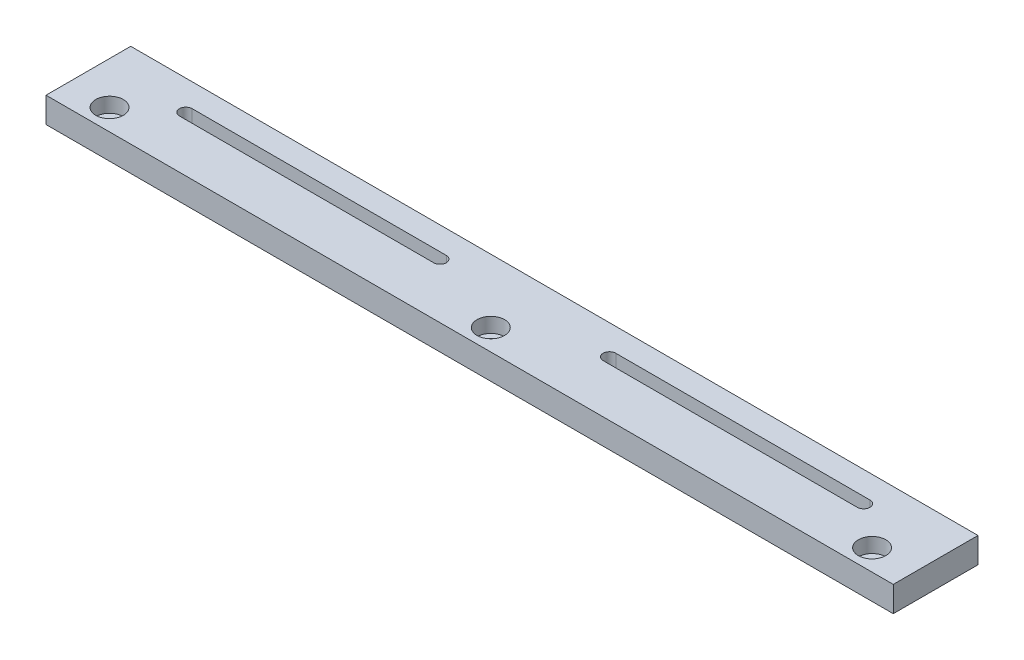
ISO-10303-21;
HEADER;
FILE_DESCRIPTION(('STEP AP214'),'2;1');
FILE_NAME('part.step','',(''),(''),'','','');
FILE_SCHEMA(('AUTOMOTIVE_DESIGN { 1 0 10303 214 1 1 1 1 }'));
ENDSEC;
DATA;
#1=APPLICATION_CONTEXT('core data for automotive mechanical design processes');
#2=APPLICATION_PROTOCOL_DEFINITION('international standard','automotive_design',2000,#1);
#3=PRODUCT_CONTEXT('',#1,'mechanical');
#4=PRODUCT('Part','Part','',(#3));
#5=PRODUCT_RELATED_PRODUCT_CATEGORY('part','',(#4));
#6=PRODUCT_DEFINITION_FORMATION('','',#4);
#7=PRODUCT_DEFINITION_CONTEXT('part definition',#1,'design');
#8=PRODUCT_DEFINITION('design','',#6,#7);
#9=PRODUCT_DEFINITION_SHAPE('','',#8);
#10=(LENGTH_UNIT() NAMED_UNIT(*) SI_UNIT(.MILLI.,.METRE.));
#11=(NAMED_UNIT(*) PLANE_ANGLE_UNIT() SI_UNIT($,.RADIAN.));
#12=(NAMED_UNIT(*) SI_UNIT($,.STERADIAN.) SOLID_ANGLE_UNIT());
#13=UNCERTAINTY_MEASURE_WITH_UNIT(LENGTH_MEASURE(1.E-05),#10,'distance_accuracy_value','');
#14=(GEOMETRIC_REPRESENTATION_CONTEXT(3) GLOBAL_UNCERTAINTY_ASSIGNED_CONTEXT((#13)) GLOBAL_UNIT_ASSIGNED_CONTEXT((#10,
#11,#12)) REPRESENTATION_CONTEXT('',''));
#15=CARTESIAN_POINT('',(0.,0.,0.));
#16=DIRECTION('',(0.,0.,1.));
#17=DIRECTION('',(1.,0.,0.));
#18=AXIS2_PLACEMENT_3D('',#15,#16,#17);
#19=CARTESIAN_POINT('',(190.,-14.,15.));
#20=DIRECTION('',(0.,1.,0.));
#21=DIRECTION('',(0.,0.,1.));
#22=AXIS2_PLACEMENT_3D('',#19,#20,#21);
#23=CYLINDRICAL_SURFACE('',#22,1.75);
#24=CARTESIAN_POINT('',(190.,0.,15.));
#25=DIRECTION('',(0.,1.,0.));
#26=DIRECTION('',(0.,0.,1.));
#27=AXIS2_PLACEMENT_3D('',#24,#25,#26);
#28=CIRCLE('',#27,1.75);
#29=CARTESIAN_POINT('',(190.,0.,16.75));
#30=VERTEX_POINT('',#29);
#31=EDGE_CURVE('E192',#30,#30,#28,.T.);
#32=ORIENTED_EDGE('',*,*,#31,.F.);
#33=EDGE_LOOP('',(#32));
#34=FACE_BOUND('',#33,.T.);
#35=CARTESIAN_POINT('',(190.,2.5,15.));
#36=DIRECTION('',(0.,1.,0.));
#37=DIRECTION('',(0.,0.,1.));
#38=AXIS2_PLACEMENT_3D('',#35,#36,#37);
#39=CIRCLE('',#38,1.75);
#40=CARTESIAN_POINT('',(190.,2.5,16.75));
#41=VERTEX_POINT('',#40);
#42=EDGE_CURVE('E36',#41,#41,#39,.F.);
#43=ORIENTED_EDGE('',*,*,#42,.F.);
#44=EDGE_LOOP('',(#43));
#45=FACE_BOUND('',#44,.T.);
#46=ADVANCED_FACE('F32',(#34,#45),#23,.F.);
#47=CARTESIAN_POINT('',(100.,-14.,15.));
#48=DIRECTION('',(0.,1.,0.));
#49=DIRECTION('',(0.,0.,1.));
#50=AXIS2_PLACEMENT_3D('',#47,#48,#49);
#51=CYLINDRICAL_SURFACE('',#50,1.75);
#52=CARTESIAN_POINT('',(100.,0.,15.));
#53=DIRECTION('',(0.,1.,0.));
#54=DIRECTION('',(0.,0.,1.));
#55=AXIS2_PLACEMENT_3D('',#52,#53,#54);
#56=CIRCLE('',#55,1.75);
#57=CARTESIAN_POINT('',(100.,0.,16.75));
#58=VERTEX_POINT('',#57);
#59=EDGE_CURVE('E195',#58,#58,#56,.T.);
#60=ORIENTED_EDGE('',*,*,#59,.F.);
#61=EDGE_LOOP('',(#60));
#62=FACE_BOUND('',#61,.T.);
#63=CARTESIAN_POINT('',(100.,2.5,15.));
#64=DIRECTION('',(0.,1.,0.));
#65=DIRECTION('',(0.,0.,1.));
#66=AXIS2_PLACEMENT_3D('',#63,#64,#65);
#67=CIRCLE('',#66,1.75);
#68=CARTESIAN_POINT('',(100.,2.5,16.75));
#69=VERTEX_POINT('',#68);
#70=EDGE_CURVE('E230',#69,#69,#67,.F.);
#71=ORIENTED_EDGE('',*,*,#70,.F.);
#72=EDGE_LOOP('',(#71));
#73=FACE_BOUND('',#72,.T.);
#74=ADVANCED_FACE('F278',(#62,#73),#51,.F.);
#75=CARTESIAN_POINT('',(10.,-14.,15.));
#76=DIRECTION('',(0.,1.,0.));
#77=DIRECTION('',(0.,0.,1.));
#78=AXIS2_PLACEMENT_3D('',#75,#76,#77);
#79=CYLINDRICAL_SURFACE('',#78,1.75);
#80=CARTESIAN_POINT('',(10.,0.,15.));
#81=DIRECTION('',(0.,1.,0.));
#82=DIRECTION('',(0.,0.,1.));
#83=AXIS2_PLACEMENT_3D('',#80,#81,#82);
#84=CIRCLE('',#83,1.75);
#85=CARTESIAN_POINT('',(10.,0.,16.75));
#86=VERTEX_POINT('',#85);
#87=EDGE_CURVE('E198',#86,#86,#84,.T.);
#88=ORIENTED_EDGE('',*,*,#87,.F.);
#89=EDGE_LOOP('',(#88));
#90=FACE_BOUND('',#89,.T.);
#91=CARTESIAN_POINT('',(10.,2.5,15.));
#92=DIRECTION('',(0.,1.,0.));
#93=DIRECTION('',(0.,0.,1.));
#94=AXIS2_PLACEMENT_3D('',#91,#92,#93);
#95=CIRCLE('',#94,1.75);
#96=CARTESIAN_POINT('',(10.,2.5,16.75));
#97=VERTEX_POINT('',#96);
#98=EDGE_CURVE('E227',#97,#97,#95,.F.);
#99=ORIENTED_EDGE('',*,*,#98,.F.);
#100=EDGE_LOOP('',(#99));
#101=FACE_BOUND('',#100,.T.);
#102=ADVANCED_FACE('F284',(#90,#101),#79,.F.);
#103=CARTESIAN_POINT('',(0.,0.,20.));
#104=DIRECTION('',(0.,1.,0.));
#105=DIRECTION('',(0.,0.,1.));
#106=AXIS2_PLACEMENT_3D('',#103,#104,#105);
#107=PLANE('',#106);
#108=DIRECTION('',(-1.,0.,0.));
#109=VECTOR('',#108,1.);
#110=CARTESIAN_POINT('',(0.,0.,5.5));
#111=LINE('',#110,#109);
#112=CARTESIAN_POINT('',(180.,0.,5.5));
#113=VERTEX_POINT('',#112);
#114=CARTESIAN_POINT('',(120.,0.,5.5));
#115=VERTEX_POINT('',#114);
#116=EDGE_CURVE('E154',#113,#115,#111,.T.);
#117=ORIENTED_EDGE('',*,*,#116,.T.);
#118=CARTESIAN_POINT('',(120.,0.,7.));
#119=DIRECTION('',(0.,1.,0.));
#120=DIRECTION('',(0.,0.,1.));
#121=AXIS2_PLACEMENT_3D('',#118,#119,#120);
#122=CIRCLE('',#121,1.5);
#123=CARTESIAN_POINT('',(120.,0.,8.5));
#124=VERTEX_POINT('',#123);
#125=EDGE_CURVE('E157',#115,#124,#122,.T.);
#126=ORIENTED_EDGE('',*,*,#125,.T.);
#127=DIRECTION('',(1.,0.,0.));
#128=VECTOR('',#127,1.);
#129=CARTESIAN_POINT('',(0.,0.,8.5));
#130=LINE('',#129,#128);
#131=CARTESIAN_POINT('',(180.,0.,8.5));
#132=VERTEX_POINT('',#131);
#133=EDGE_CURVE('E149',#124,#132,#130,.T.);
#134=ORIENTED_EDGE('',*,*,#133,.T.);
#135=CARTESIAN_POINT('',(180.,0.,7.));
#136=DIRECTION('',(0.,1.,0.));
#137=DIRECTION('',(0.,0.,1.));
#138=AXIS2_PLACEMENT_3D('',#135,#136,#137);
#139=CIRCLE('',#138,1.5);
#140=EDGE_CURVE('E129',#132,#113,#139,.T.);
#141=ORIENTED_EDGE('',*,*,#140,.T.);
#142=EDGE_LOOP('',(#117,#126,#134,#141));
#143=FACE_BOUND('',#142,.T.);
#144=DIRECTION('',(-1.,0.,0.));
#145=VECTOR('',#144,1.);
#146=CARTESIAN_POINT('',(0.,0.,5.5));
#147=LINE('',#146,#145);
#148=CARTESIAN_POINT('',(80.,0.,5.5));
#149=VERTEX_POINT('',#148);
#150=CARTESIAN_POINT('',(20.,0.,5.5));
#151=VERTEX_POINT('',#150);
#152=EDGE_CURVE('E186',#149,#151,#147,.T.);
#153=ORIENTED_EDGE('',*,*,#152,.T.);
#154=CARTESIAN_POINT('',(20.,0.,7.));
#155=DIRECTION('',(0.,1.,0.));
#156=DIRECTION('',(0.,0.,1.));
#157=AXIS2_PLACEMENT_3D('',#154,#155,#156);
#158=CIRCLE('',#157,1.5);
#159=CARTESIAN_POINT('',(20.,0.,8.5));
#160=VERTEX_POINT('',#159);
#161=EDGE_CURVE('E189',#151,#160,#158,.T.);
#162=ORIENTED_EDGE('',*,*,#161,.T.);
#163=DIRECTION('',(1.,0.,0.));
#164=VECTOR('',#163,1.);
#165=CARTESIAN_POINT('',(0.,0.,8.5));
#166=LINE('',#165,#164);
#167=CARTESIAN_POINT('',(80.,0.,8.5));
#168=VERTEX_POINT('',#167);
#169=EDGE_CURVE('E174',#160,#168,#166,.T.);
#170=ORIENTED_EDGE('',*,*,#169,.T.);
#171=CARTESIAN_POINT('',(80.,0.,7.));
#172=DIRECTION('',(0.,1.,0.));
#173=DIRECTION('',(0.,0.,1.));
#174=AXIS2_PLACEMENT_3D('',#171,#172,#173);
#175=CIRCLE('',#174,1.5);
#176=EDGE_CURVE('E183',#168,#149,#175,.T.);
#177=ORIENTED_EDGE('',*,*,#176,.T.);
#178=EDGE_LOOP('',(#153,#162,#170,#177));
#179=FACE_BOUND('',#178,.T.);
#180=ORIENTED_EDGE('',*,*,#31,.T.);
#181=EDGE_LOOP('',(#180));
#182=FACE_BOUND('',#181,.T.);
#183=ORIENTED_EDGE('',*,*,#59,.T.);
#184=EDGE_LOOP('',(#183));
#185=FACE_BOUND('',#184,.T.);
#186=ORIENTED_EDGE('',*,*,#87,.T.);
#187=EDGE_LOOP('',(#186));
#188=FACE_BOUND('',#187,.T.);
#189=DIRECTION('',(1.,0.,0.));
#190=VECTOR('',#189,1.);
#191=CARTESIAN_POINT('',(0.,0.,0.));
#192=LINE('',#191,#190);
#193=CARTESIAN_POINT('',(0.,0.,0.));
#194=VERTEX_POINT('',#193);
#195=CARTESIAN_POINT('',(200.,0.,0.));
#196=VERTEX_POINT('',#195);
#197=EDGE_CURVE('E201',#194,#196,#192,.T.);
#198=ORIENTED_EDGE('',*,*,#197,.T.);
#199=DIRECTION('',(0.,0.,-1.));
#200=VECTOR('',#199,1.);
#201=CARTESIAN_POINT('',(200.,0.,20.));
#202=LINE('',#201,#200);
#203=CARTESIAN_POINT('',(200.,0.,20.));
#204=VERTEX_POINT('',#203);
#205=EDGE_CURVE('E11',#204,#196,#202,.T.);
#206=ORIENTED_EDGE('',*,*,#205,.F.);
#207=DIRECTION('',(1.,0.,0.));
#208=VECTOR('',#207,1.);
#209=CARTESIAN_POINT('',(0.,0.,20.));
#210=LINE('',#209,#208);
#211=CARTESIAN_POINT('',(0.,0.,20.));
#212=VERTEX_POINT('',#211);
#213=EDGE_CURVE('E202',#212,#204,#210,.T.);
#214=ORIENTED_EDGE('',*,*,#213,.F.);
#215=DIRECTION('',(0.,0.,-1.));
#216=VECTOR('',#215,1.);
#217=CARTESIAN_POINT('',(0.,0.,20.));
#218=LINE('',#217,#216);
#219=EDGE_CURVE('E212',#212,#194,#218,.T.);
#220=ORIENTED_EDGE('',*,*,#219,.T.);
#221=EDGE_LOOP('',(#198,#206,#214,#220));
#222=FACE_BOUND('',#221,.T.);
#223=ADVANCED_FACE('F34',(#143,#179,#182,#185,#188,#222),#107,.F.);
#224=CARTESIAN_POINT('',(200.,0.,20.));
#225=DIRECTION('',(-1.,0.,0.));
#226=DIRECTION('',(0.,0.,1.));
#227=AXIS2_PLACEMENT_3D('',#224,#225,#226);
#228=PLANE('',#227);
#229=DIRECTION('',(0.,1.,0.));
#230=VECTOR('',#229,1.);
#231=CARTESIAN_POINT('',(200.,0.,0.));
#232=LINE('',#231,#230);
#233=CARTESIAN_POINT('',(200.,6.,0.));
#234=VERTEX_POINT('',#233);
#235=EDGE_CURVE('E215',#196,#234,#232,.T.);
#236=ORIENTED_EDGE('',*,*,#235,.T.);
#237=DIRECTION('',(0.,0.,-1.));
#238=VECTOR('',#237,1.);
#239=CARTESIAN_POINT('',(200.,6.,20.));
#240=LINE('',#239,#238);
#241=CARTESIAN_POINT('',(200.,6.,20.));
#242=VERTEX_POINT('',#241);
#243=EDGE_CURVE('E41',#242,#234,#240,.T.);
#244=ORIENTED_EDGE('',*,*,#243,.F.);
#245=DIRECTION('',(0.,1.,0.));
#246=VECTOR('',#245,1.);
#247=CARTESIAN_POINT('',(200.,0.,20.));
#248=LINE('',#247,#246);
#249=EDGE_CURVE('E205',#204,#242,#248,.T.);
#250=ORIENTED_EDGE('',*,*,#249,.F.);
#251=ORIENTED_EDGE('',*,*,#205,.T.);
#252=EDGE_LOOP('',(#236,#244,#250,#251));
#253=FACE_BOUND('',#252,.T.);
#254=ADVANCED_FACE('F264',(#253),#228,.F.);
#255=CARTESIAN_POINT('',(0.,6.,20.));
#256=DIRECTION('',(0.,-1.,0.));
#257=DIRECTION('',(0.,0.,-1.));
#258=AXIS2_PLACEMENT_3D('',#255,#256,#257);
#259=PLANE('',#258);
#260=CARTESIAN_POINT('',(190.,6.,15.));
#261=DIRECTION('',(0.,1.,0.));
#262=DIRECTION('',(0.,0.,1.));
#263=AXIS2_PLACEMENT_3D('',#260,#261,#262);
#264=CIRCLE('',#263,3.25);
#265=CARTESIAN_POINT('',(190.,6.,18.25));
#266=VERTEX_POINT('',#265);
#267=EDGE_CURVE('E246',#266,#266,#264,.T.);
#268=ORIENTED_EDGE('',*,*,#267,.F.);
#269=EDGE_LOOP('',(#268));
#270=FACE_BOUND('',#269,.T.);
#271=CARTESIAN_POINT('',(100.,6.,15.));
#272=DIRECTION('',(0.,1.,0.));
#273=DIRECTION('',(0.,0.,1.));
#274=AXIS2_PLACEMENT_3D('',#271,#272,#273);
#275=CIRCLE('',#274,3.25);
#276=CARTESIAN_POINT('',(100.,6.,18.25));
#277=VERTEX_POINT('',#276);
#278=EDGE_CURVE('E239',#277,#277,#275,.T.);
#279=ORIENTED_EDGE('',*,*,#278,.F.);
#280=EDGE_LOOP('',(#279));
#281=FACE_BOUND('',#280,.T.);
#282=CARTESIAN_POINT('',(10.,6.,15.));
#283=DIRECTION('',(0.,1.,0.));
#284=DIRECTION('',(0.,0.,1.));
#285=AXIS2_PLACEMENT_3D('',#282,#283,#284);
#286=CIRCLE('',#285,3.25);
#287=CARTESIAN_POINT('',(10.,6.,18.25));
#288=VERTEX_POINT('',#287);
#289=EDGE_CURVE('E232',#288,#288,#286,.T.);
#290=ORIENTED_EDGE('',*,*,#289,.F.);
#291=EDGE_LOOP('',(#290));
#292=FACE_BOUND('',#291,.T.);
#293=DIRECTION('',(1.,0.,0.));
#294=VECTOR('',#293,1.);
#295=CARTESIAN_POINT('',(120.,6.,8.5));
#296=LINE('',#295,#294);
#297=CARTESIAN_POINT('',(120.,6.,8.5));
#298=VERTEX_POINT('',#297);
#299=CARTESIAN_POINT('',(180.,6.,8.5));
#300=VERTEX_POINT('',#299);
#301=EDGE_CURVE('E135',#298,#300,#296,.T.);
#302=ORIENTED_EDGE('',*,*,#301,.F.);
#303=CARTESIAN_POINT('',(120.,6.,7.));
#304=DIRECTION('',(0.,1.,0.));
#305=DIRECTION('',(0.,0.,1.));
#306=AXIS2_PLACEMENT_3D('',#303,#304,#305);
#307=CIRCLE('',#306,1.5);
#308=CARTESIAN_POINT('',(120.,6.,5.5));
#309=VERTEX_POINT('',#308);
#310=EDGE_CURVE('E57',#309,#298,#307,.T.);
#311=ORIENTED_EDGE('',*,*,#310,.F.);
#312=DIRECTION('',(-1.,0.,0.));
#313=VECTOR('',#312,1.);
#314=CARTESIAN_POINT('',(120.,6.,5.5));
#315=LINE('',#314,#313);
#316=CARTESIAN_POINT('',(180.,6.,5.5));
#317=VERTEX_POINT('',#316);
#318=EDGE_CURVE('E142',#317,#309,#315,.T.);
#319=ORIENTED_EDGE('',*,*,#318,.F.);
#320=CARTESIAN_POINT('',(180.,6.,7.));
#321=DIRECTION('',(0.,1.,0.));
#322=DIRECTION('',(0.,0.,1.));
#323=AXIS2_PLACEMENT_3D('',#320,#321,#322);
#324=CIRCLE('',#323,1.5);
#325=EDGE_CURVE('E126',#300,#317,#324,.T.);
#326=ORIENTED_EDGE('',*,*,#325,.F.);
#327=EDGE_LOOP('',(#302,#311,#319,#326));
#328=FACE_BOUND('',#327,.T.);
#329=DIRECTION('',(1.,0.,0.));
#330=VECTOR('',#329,1.);
#331=CARTESIAN_POINT('',(20.,6.,8.5));
#332=LINE('',#331,#330);
#333=CARTESIAN_POINT('',(20.,6.,8.5));
#334=VERTEX_POINT('',#333);
#335=CARTESIAN_POINT('',(80.,6.,8.5));
#336=VERTEX_POINT('',#335);
#337=EDGE_CURVE('E162',#334,#336,#332,.T.);
#338=ORIENTED_EDGE('',*,*,#337,.F.);
#339=CARTESIAN_POINT('',(20.,6.,7.));
#340=DIRECTION('',(0.,1.,0.));
#341=DIRECTION('',(0.,0.,1.));
#342=AXIS2_PLACEMENT_3D('',#339,#340,#341);
#343=CIRCLE('',#342,1.5);
#344=CARTESIAN_POINT('',(20.,6.,5.5));
#345=VERTEX_POINT('',#344);
#346=EDGE_CURVE('E160',#345,#334,#343,.T.);
#347=ORIENTED_EDGE('',*,*,#346,.F.);
#348=DIRECTION('',(-1.,0.,0.));
#349=VECTOR('',#348,1.);
#350=CARTESIAN_POINT('',(20.,6.,5.5));
#351=LINE('',#350,#349);
#352=CARTESIAN_POINT('',(80.,6.,5.5));
#353=VERTEX_POINT('',#352);
#354=EDGE_CURVE('E168',#353,#345,#351,.T.);
#355=ORIENTED_EDGE('',*,*,#354,.F.);
#356=CARTESIAN_POINT('',(80.,6.,7.));
#357=DIRECTION('',(0.,1.,0.));
#358=DIRECTION('',(0.,0.,1.));
#359=AXIS2_PLACEMENT_3D('',#356,#357,#358);
#360=CIRCLE('',#359,1.5);
#361=EDGE_CURVE('E165',#336,#353,#360,.T.);
#362=ORIENTED_EDGE('',*,*,#361,.F.);
#363=EDGE_LOOP('',(#338,#347,#355,#362));
#364=FACE_BOUND('',#363,.T.);
#365=DIRECTION('',(-1.,0.,0.));
#366=VECTOR('',#365,1.);
#367=CARTESIAN_POINT('',(0.,6.,0.));
#368=LINE('',#367,#366);
#369=CARTESIAN_POINT('',(0.,6.,0.));
#370=VERTEX_POINT('',#369);
#371=EDGE_CURVE('E217',#234,#370,#368,.T.);
#372=ORIENTED_EDGE('',*,*,#371,.T.);
#373=DIRECTION('',(0.,0.,-1.));
#374=VECTOR('',#373,1.);
#375=CARTESIAN_POINT('',(0.,6.,20.));
#376=LINE('',#375,#374);
#377=CARTESIAN_POINT('',(0.,6.,20.));
#378=VERTEX_POINT('',#377);
#379=EDGE_CURVE('E222',#378,#370,#376,.T.);
#380=ORIENTED_EDGE('',*,*,#379,.F.);
#381=DIRECTION('',(-1.,0.,0.));
#382=VECTOR('',#381,1.);
#383=CARTESIAN_POINT('',(0.,6.,20.));
#384=LINE('',#383,#382);
#385=EDGE_CURVE('E208',#242,#378,#384,.T.);
#386=ORIENTED_EDGE('',*,*,#385,.F.);
#387=ORIENTED_EDGE('',*,*,#243,.T.);
#388=EDGE_LOOP('',(#372,#380,#386,#387));
#389=FACE_BOUND('',#388,.T.);
#390=ADVANCED_FACE('F139',(#270,#281,#292,#328,#364,#389),#259,.F.);
#391=CARTESIAN_POINT('',(0.,0.,20.));
#392=DIRECTION('',(1.,0.,0.));
#393=DIRECTION('',(0.,0.,-1.));
#394=AXIS2_PLACEMENT_3D('',#391,#392,#393);
#395=PLANE('',#394);
#396=DIRECTION('',(0.,-1.,0.));
#397=VECTOR('',#396,1.);
#398=CARTESIAN_POINT('',(0.,0.,0.));
#399=LINE('',#398,#397);
#400=EDGE_CURVE('E206',#370,#194,#399,.T.);
#401=ORIENTED_EDGE('',*,*,#400,.T.);
#402=ORIENTED_EDGE('',*,*,#219,.F.);
#403=DIRECTION('',(0.,-1.,0.));
#404=VECTOR('',#403,1.);
#405=CARTESIAN_POINT('',(0.,0.,20.));
#406=LINE('',#405,#404);
#407=EDGE_CURVE('E210',#378,#212,#406,.T.);
#408=ORIENTED_EDGE('',*,*,#407,.F.);
#409=ORIENTED_EDGE('',*,*,#379,.T.);
#410=EDGE_LOOP('',(#401,#402,#408,#409));
#411=FACE_BOUND('',#410,.T.);
#412=ADVANCED_FACE('F263',(#411),#395,.F.);
#413=CARTESIAN_POINT('',(200.,0.,20.));
#414=DIRECTION('',(0.,0.,1.));
#415=DIRECTION('',(1.,0.,0.));
#416=AXIS2_PLACEMENT_3D('',#413,#414,#415);
#417=PLANE('',#416);
#418=ORIENTED_EDGE('',*,*,#213,.T.);
#419=ORIENTED_EDGE('',*,*,#249,.T.);
#420=ORIENTED_EDGE('',*,*,#385,.T.);
#421=ORIENTED_EDGE('',*,*,#407,.T.);
#422=EDGE_LOOP('',(#418,#419,#420,#421));
#423=FACE_BOUND('',#422,.T.);
#424=ADVANCED_FACE('F271',(#423),#417,.T.);
#425=CARTESIAN_POINT('',(200.,0.,0.));
#426=DIRECTION('',(0.,0.,1.));
#427=DIRECTION('',(1.,0.,0.));
#428=AXIS2_PLACEMENT_3D('',#425,#426,#427);
#429=PLANE('',#428);
#430=ORIENTED_EDGE('',*,*,#197,.F.);
#431=ORIENTED_EDGE('',*,*,#400,.F.);
#432=ORIENTED_EDGE('',*,*,#371,.F.);
#433=ORIENTED_EDGE('',*,*,#235,.F.);
#434=EDGE_LOOP('',(#430,#431,#432,#433));
#435=FACE_BOUND('',#434,.T.);
#436=ADVANCED_FACE('F298',(#435),#429,.F.);
#437=CARTESIAN_POINT('',(20.,-14.,7.));
#438=DIRECTION('',(0.,1.,0.));
#439=DIRECTION('',(0.,0.,1.));
#440=AXIS2_PLACEMENT_3D('',#437,#438,#439);
#441=CYLINDRICAL_SURFACE('',#440,1.5);
#442=DIRECTION('',(0.,1.,0.));
#443=VECTOR('',#442,1.);
#444=CARTESIAN_POINT('',(20.,-14.,5.5));
#445=LINE('',#444,#443);
#446=EDGE_CURVE('E172',#151,#345,#445,.T.);
#447=ORIENTED_EDGE('',*,*,#446,.T.);
#448=ORIENTED_EDGE('',*,*,#346,.T.);
#449=DIRECTION('',(0.,1.,0.));
#450=VECTOR('',#449,1.);
#451=CARTESIAN_POINT('',(20.,-14.,8.5));
#452=LINE('',#451,#450);
#453=EDGE_CURVE('E171',#160,#334,#452,.T.);
#454=ORIENTED_EDGE('',*,*,#453,.F.);
#455=ORIENTED_EDGE('',*,*,#161,.F.);
#456=EDGE_LOOP('',(#447,#448,#454,#455));
#457=FACE_BOUND('',#456,.T.);
#458=ADVANCED_FACE('F290',(#457),#441,.F.);
#459=CARTESIAN_POINT('',(20.,-14.,5.5));
#460=DIRECTION('',(0.,0.,-1.));
#461=DIRECTION('',(-1.,0.,0.));
#462=AXIS2_PLACEMENT_3D('',#459,#460,#461);
#463=PLANE('',#462);
#464=DIRECTION('',(0.,1.,0.));
#465=VECTOR('',#464,1.);
#466=CARTESIAN_POINT('',(80.,-14.,5.5));
#467=LINE('',#466,#465);
#468=EDGE_CURVE('E175',#149,#353,#467,.T.);
#469=ORIENTED_EDGE('',*,*,#468,.T.);
#470=ORIENTED_EDGE('',*,*,#354,.T.);
#471=ORIENTED_EDGE('',*,*,#446,.F.);
#472=ORIENTED_EDGE('',*,*,#152,.F.);
#473=EDGE_LOOP('',(#469,#470,#471,#472));
#474=FACE_BOUND('',#473,.T.);
#475=ADVANCED_FACE('F305',(#474),#463,.F.);
#476=CARTESIAN_POINT('',(80.,-14.,7.));
#477=DIRECTION('',(0.,1.,0.));
#478=DIRECTION('',(0.,0.,1.));
#479=AXIS2_PLACEMENT_3D('',#476,#477,#478);
#480=CYLINDRICAL_SURFACE('',#479,1.5);
#481=DIRECTION('',(0.,1.,0.));
#482=VECTOR('',#481,1.);
#483=CARTESIAN_POINT('',(80.,-14.,8.5));
#484=LINE('',#483,#482);
#485=EDGE_CURVE('E177',#168,#336,#484,.T.);
#486=ORIENTED_EDGE('',*,*,#485,.T.);
#487=ORIENTED_EDGE('',*,*,#361,.T.);
#488=ORIENTED_EDGE('',*,*,#468,.F.);
#489=ORIENTED_EDGE('',*,*,#176,.F.);
#490=EDGE_LOOP('',(#486,#487,#488,#489));
#491=FACE_BOUND('',#490,.T.);
#492=ADVANCED_FACE('F353',(#491),#480,.F.);
#493=CARTESIAN_POINT('',(20.,-14.,8.5));
#494=DIRECTION('',(0.,0.,1.));
#495=DIRECTION('',(1.,0.,0.));
#496=AXIS2_PLACEMENT_3D('',#493,#494,#495);
#497=PLANE('',#496);
#498=ORIENTED_EDGE('',*,*,#453,.T.);
#499=ORIENTED_EDGE('',*,*,#337,.T.);
#500=ORIENTED_EDGE('',*,*,#485,.F.);
#501=ORIENTED_EDGE('',*,*,#169,.F.);
#502=EDGE_LOOP('',(#498,#499,#500,#501));
#503=FACE_BOUND('',#502,.T.);
#504=ADVANCED_FACE('F350',(#503),#497,.F.);
#505=CARTESIAN_POINT('',(120.,-14.,7.));
#506=DIRECTION('',(0.,1.,0.));
#507=DIRECTION('',(0.,0.,1.));
#508=AXIS2_PLACEMENT_3D('',#505,#506,#507);
#509=CYLINDRICAL_SURFACE('',#508,1.5);
#510=DIRECTION('',(0.,1.,0.));
#511=VECTOR('',#510,1.);
#512=CARTESIAN_POINT('',(120.,-14.,5.5));
#513=LINE('',#512,#511);
#514=EDGE_CURVE('E147',#115,#309,#513,.T.);
#515=ORIENTED_EDGE('',*,*,#514,.T.);
#516=ORIENTED_EDGE('',*,*,#310,.T.);
#517=DIRECTION('',(0.,1.,0.));
#518=VECTOR('',#517,1.);
#519=CARTESIAN_POINT('',(120.,-14.,8.5));
#520=LINE('',#519,#518);
#521=EDGE_CURVE('E132',#124,#298,#520,.T.);
#522=ORIENTED_EDGE('',*,*,#521,.F.);
#523=ORIENTED_EDGE('',*,*,#125,.F.);
#524=EDGE_LOOP('',(#515,#516,#522,#523));
#525=FACE_BOUND('',#524,.T.);
#526=ADVANCED_FACE('F344',(#525),#509,.F.);
#527=CARTESIAN_POINT('',(120.,-14.,5.5));
#528=DIRECTION('',(0.,0.,-1.));
#529=DIRECTION('',(-1.,0.,0.));
#530=AXIS2_PLACEMENT_3D('',#527,#528,#529);
#531=PLANE('',#530);
#532=DIRECTION('',(0.,1.,0.));
#533=VECTOR('',#532,1.);
#534=CARTESIAN_POINT('',(180.,-14.,5.5));
#535=LINE('',#534,#533);
#536=EDGE_CURVE('E131',#113,#317,#535,.T.);
#537=ORIENTED_EDGE('',*,*,#536,.T.);
#538=ORIENTED_EDGE('',*,*,#318,.T.);
#539=ORIENTED_EDGE('',*,*,#514,.F.);
#540=ORIENTED_EDGE('',*,*,#116,.F.);
#541=EDGE_LOOP('',(#537,#538,#539,#540));
#542=FACE_BOUND('',#541,.T.);
#543=ADVANCED_FACE('F341',(#542),#531,.F.);
#544=CARTESIAN_POINT('',(180.,-14.,7.));
#545=DIRECTION('',(0.,1.,0.));
#546=DIRECTION('',(0.,0.,1.));
#547=AXIS2_PLACEMENT_3D('',#544,#545,#546);
#548=CYLINDRICAL_SURFACE('',#547,1.5);
#549=DIRECTION('',(0.,1.,0.));
#550=VECTOR('',#549,1.);
#551=CARTESIAN_POINT('',(180.,-14.,8.5));
#552=LINE('',#551,#550);
#553=EDGE_CURVE('E49',#132,#300,#552,.T.);
#554=ORIENTED_EDGE('',*,*,#553,.T.);
#555=ORIENTED_EDGE('',*,*,#325,.T.);
#556=ORIENTED_EDGE('',*,*,#536,.F.);
#557=ORIENTED_EDGE('',*,*,#140,.F.);
#558=EDGE_LOOP('',(#554,#555,#556,#557));
#559=FACE_BOUND('',#558,.T.);
#560=ADVANCED_FACE('F123',(#559),#548,.F.);
#561=CARTESIAN_POINT('',(120.,-14.,8.5));
#562=DIRECTION('',(0.,0.,1.));
#563=DIRECTION('',(1.,0.,0.));
#564=AXIS2_PLACEMENT_3D('',#561,#562,#563);
#565=PLANE('',#564);
#566=ORIENTED_EDGE('',*,*,#521,.T.);
#567=ORIENTED_EDGE('',*,*,#301,.T.);
#568=ORIENTED_EDGE('',*,*,#553,.F.);
#569=ORIENTED_EDGE('',*,*,#133,.F.);
#570=EDGE_LOOP('',(#566,#567,#568,#569));
#571=FACE_BOUND('',#570,.T.);
#572=ADVANCED_FACE('F136',(#571),#565,.F.);
#573=CARTESIAN_POINT('',(10.,2.5,15.));
#574=DIRECTION('',(0.,1.,0.));
#575=DIRECTION('',(0.,0.,1.));
#576=AXIS2_PLACEMENT_3D('',#573,#574,#575);
#577=PLANE('',#576);
#578=CARTESIAN_POINT('',(10.,2.5,15.));
#579=DIRECTION('',(0.,1.,0.));
#580=DIRECTION('',(0.,0.,1.));
#581=AXIS2_PLACEMENT_3D('',#578,#579,#580);
#582=CIRCLE('',#581,3.25);
#583=CARTESIAN_POINT('',(10.,2.5,18.25));
#584=VERTEX_POINT('',#583);
#585=EDGE_CURVE('E229',#584,#584,#582,.T.);
#586=ORIENTED_EDGE('',*,*,#585,.T.);
#587=EDGE_LOOP('',(#586));
#588=FACE_BOUND('',#587,.T.);
#589=ORIENTED_EDGE('',*,*,#98,.T.);
#590=EDGE_LOOP('',(#589));
#591=FACE_BOUND('',#590,.T.);
#592=ADVANCED_FACE('F252',(#588,#591),#577,.T.);
#593=CARTESIAN_POINT('',(10.,2.5,15.));
#594=DIRECTION('',(0.,1.,0.));
#595=DIRECTION('',(0.,0.,1.));
#596=AXIS2_PLACEMENT_3D('',#593,#594,#595);
#597=CYLINDRICAL_SURFACE('',#596,3.25);
#598=ORIENTED_EDGE('',*,*,#585,.F.);
#599=EDGE_LOOP('',(#598));
#600=FACE_BOUND('',#599,.T.);
#601=ORIENTED_EDGE('',*,*,#289,.T.);
#602=EDGE_LOOP('',(#601));
#603=FACE_BOUND('',#602,.T.);
#604=ADVANCED_FACE('F255',(#600,#603),#597,.F.);
#605=CARTESIAN_POINT('',(100.,2.5,15.));
#606=DIRECTION('',(0.,1.,0.));
#607=DIRECTION('',(0.,0.,1.));
#608=AXIS2_PLACEMENT_3D('',#605,#606,#607);
#609=PLANE('',#608);
#610=CARTESIAN_POINT('',(100.,2.5,15.));
#611=DIRECTION('',(0.,1.,0.));
#612=DIRECTION('',(0.,0.,1.));
#613=AXIS2_PLACEMENT_3D('',#610,#611,#612);
#614=CIRCLE('',#613,3.25);
#615=CARTESIAN_POINT('',(100.,2.5,18.25));
#616=VERTEX_POINT('',#615);
#617=EDGE_CURVE('E233',#616,#616,#614,.T.);
#618=ORIENTED_EDGE('',*,*,#617,.T.);
#619=EDGE_LOOP('',(#618));
#620=FACE_BOUND('',#619,.T.);
#621=ORIENTED_EDGE('',*,*,#70,.T.);
#622=EDGE_LOOP('',(#621));
#623=FACE_BOUND('',#622,.T.);
#624=ADVANCED_FACE('F258',(#620,#623),#609,.T.);
#625=CARTESIAN_POINT('',(100.,2.5,15.));
#626=DIRECTION('',(0.,1.,0.));
#627=DIRECTION('',(0.,0.,1.));
#628=AXIS2_PLACEMENT_3D('',#625,#626,#627);
#629=CYLINDRICAL_SURFACE('',#628,3.25);
#630=ORIENTED_EDGE('',*,*,#617,.F.);
#631=EDGE_LOOP('',(#630));
#632=FACE_BOUND('',#631,.T.);
#633=ORIENTED_EDGE('',*,*,#278,.T.);
#634=EDGE_LOOP('',(#633));
#635=FACE_BOUND('',#634,.T.);
#636=ADVANCED_FACE('F338',(#632,#635),#629,.F.);
#637=CARTESIAN_POINT('',(190.,2.5,15.));
#638=DIRECTION('',(0.,1.,0.));
#639=DIRECTION('',(0.,0.,1.));
#640=AXIS2_PLACEMENT_3D('',#637,#638,#639);
#641=PLANE('',#640);
#642=CARTESIAN_POINT('',(190.,2.5,15.));
#643=DIRECTION('',(0.,1.,0.));
#644=DIRECTION('',(0.,0.,1.));
#645=AXIS2_PLACEMENT_3D('',#642,#643,#644);
#646=CIRCLE('',#645,3.25);
#647=CARTESIAN_POINT('',(190.,2.5,18.25));
#648=VERTEX_POINT('',#647);
#649=EDGE_CURVE('E461',#648,#648,#646,.T.);
#650=ORIENTED_EDGE('',*,*,#649,.T.);
#651=EDGE_LOOP('',(#650));
#652=FACE_BOUND('',#651,.T.);
#653=ORIENTED_EDGE('',*,*,#42,.T.);
#654=EDGE_LOOP('',(#653));
#655=FACE_BOUND('',#654,.T.);
#656=ADVANCED_FACE('F435',(#652,#655),#641,.T.);
#657=CARTESIAN_POINT('',(190.,2.5,15.));
#658=DIRECTION('',(0.,1.,0.));
#659=DIRECTION('',(0.,0.,1.));
#660=AXIS2_PLACEMENT_3D('',#657,#658,#659);
#661=CYLINDRICAL_SURFACE('',#660,3.25);
#662=ORIENTED_EDGE('',*,*,#649,.F.);
#663=EDGE_LOOP('',(#662));
#664=FACE_BOUND('',#663,.T.);
#665=ORIENTED_EDGE('',*,*,#267,.T.);
#666=EDGE_LOOP('',(#665));
#667=FACE_BOUND('',#666,.T.);
#668=ADVANCED_FACE('F444',(#664,#667),#661,.F.);
#669=CLOSED_SHELL('',(#46,#74,#102,#223,#254,#390,#412,#424,#436,#458,#475,#492,#504,#526,#543,
#560,#572,#592,#604,#624,#636,#656,#668));
#670=MANIFOLD_SOLID_BREP('B2',#669);
#671=ADVANCED_BREP_SHAPE_REPRESENTATION('',(#18,#670),#14);
#672=SHAPE_DEFINITION_REPRESENTATION(#9,#671);
ENDSEC;
END-ISO-10303-21;
